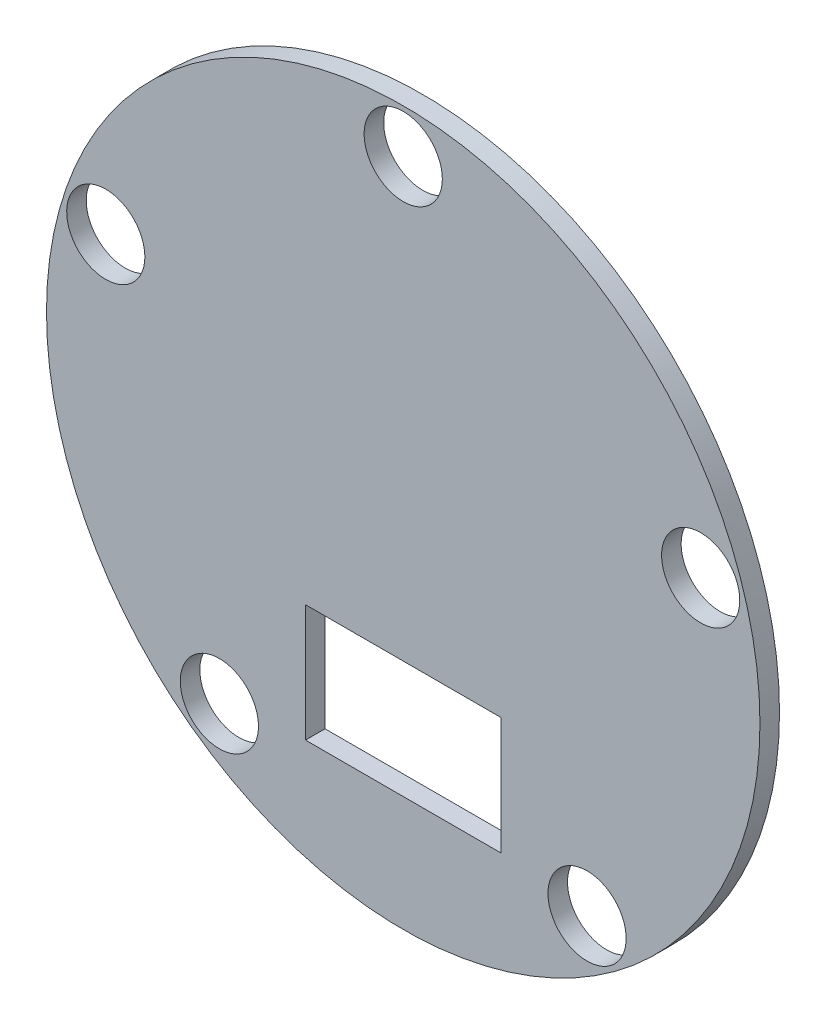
from build123d import *

# Parameters (mm, degrees)
SKETCH1_R           = 115.8875
BOSS_EXTRUDE1_DEPTH = 6.35
SKETCH2_R           = 12.7
CUT_EXTRUDE1_DEPTH  = 165.012645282
CIRPATTERN1_COUNT   = 5
SKETCH5_W           = 63.5
SKETCH5_H           = 38.1
CUT_EXTRUDE2_DEPTH  = 165.012645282


with BuildPart() as part:
    # Sketch1 → Boss-Extrude1 (new body)
    with BuildSketch(Plane.XY):
        Circle(SKETCH1_R)
    extrude(amount=BOSS_EXTRUDE1_DEPTH)

    # Sketch2 → Cut-Extrude1 (cut, through all)
    with BuildSketch(Plane.XY.offset(6.35)):
        with Locations((0, 101.6)):
            Circle(SKETCH2_R)
    cut_extrude1 = extrude(amount=-CUT_EXTRUDE1_DEPTH, mode=Mode.SUBTRACT)

    # CirPattern1: Cut-Extrude1 ×5 about axis
    cirpattern1_axis = Axis((0, 0, 0), (0, 0, 1))
    for i in range(1, CIRPATTERN1_COUNT):
        add(cut_extrude1.rotate(cirpattern1_axis, i * 360 / CIRPATTERN1_COUNT), mode=Mode.SUBTRACT)

    # Sketch5 → Cut-Extrude2 (cut, through all)
    with BuildSketch(Plane.XY.offset(6.35)):
        with Locations((0, -59.404230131)):
            Rectangle(SKETCH5_W, SKETCH5_H)
    extrude(amount=-CUT_EXTRUDE2_DEPTH, mode=Mode.SUBTRACT)


solid = part.part
